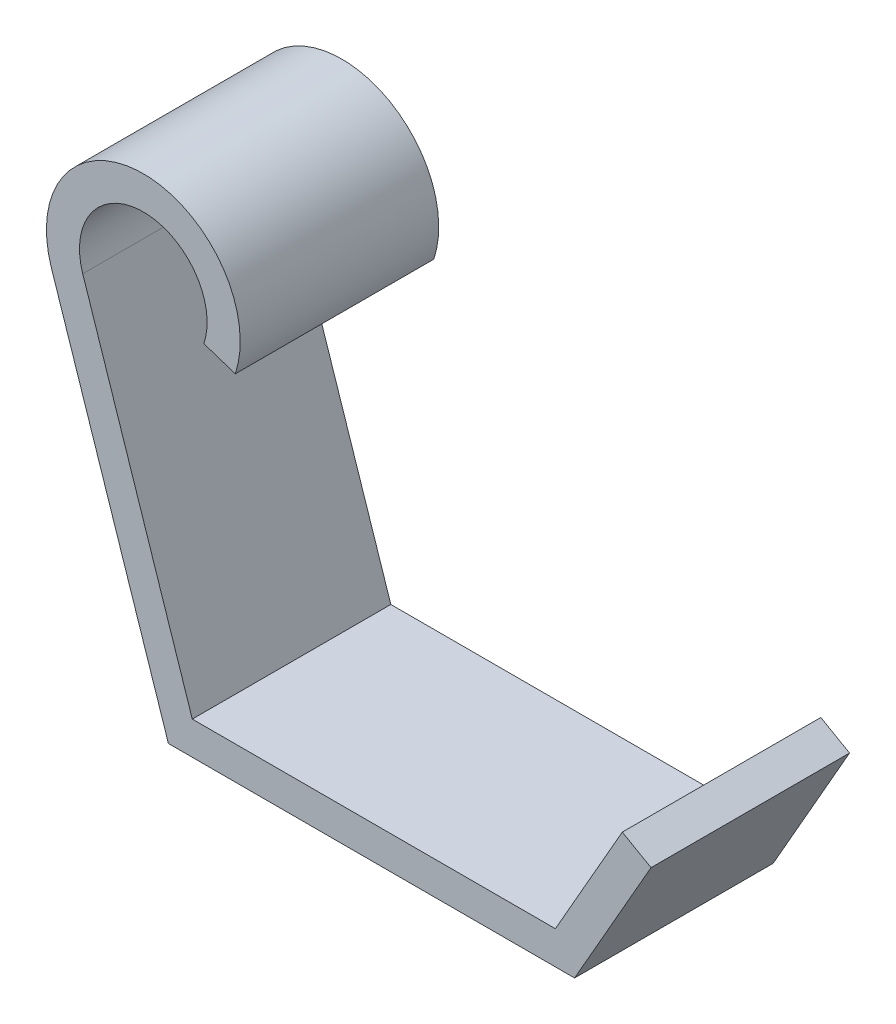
from build123d import *

# Parameters (mm, degrees)
EXTRUDE_THIN2_DEPTH = 30


with BuildPart() as part:
    # Sketch1 → Extrude-Thin2 (new body)
    with BuildSketch(Plane.XY):
        with BuildLine():
            Line((72.929431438, 20.218060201), (61.376254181, 0))
            Line((61.376254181, 0), (0, 0))
            Line((0, 0), (-17.690802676, 53.433444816))
            ThreePointArc((-17.690802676, 53.433444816), (-3.790886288, 72.677372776), (10.1090301, 53.433444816))
            Line((10.1090301, 53.433444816), (5.362416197, 55.004958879))
            ThreePointArc((5.362416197, 55.004958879), (-3.790886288, 67.677372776), (-12.944188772, 55.004958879))
            Line((-12.944188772, 55.004958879), (3.611507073, 5))
            Line((3.611507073, 5), (58.474641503, 5))
            Line((58.474641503, 5), (68.588215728, 22.698754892))
            Line((68.588215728, 22.698754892), (72.929431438, 20.218060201))
        make_face()
    extrude(amount=EXTRUDE_THIN2_DEPTH)


solid = part.part
